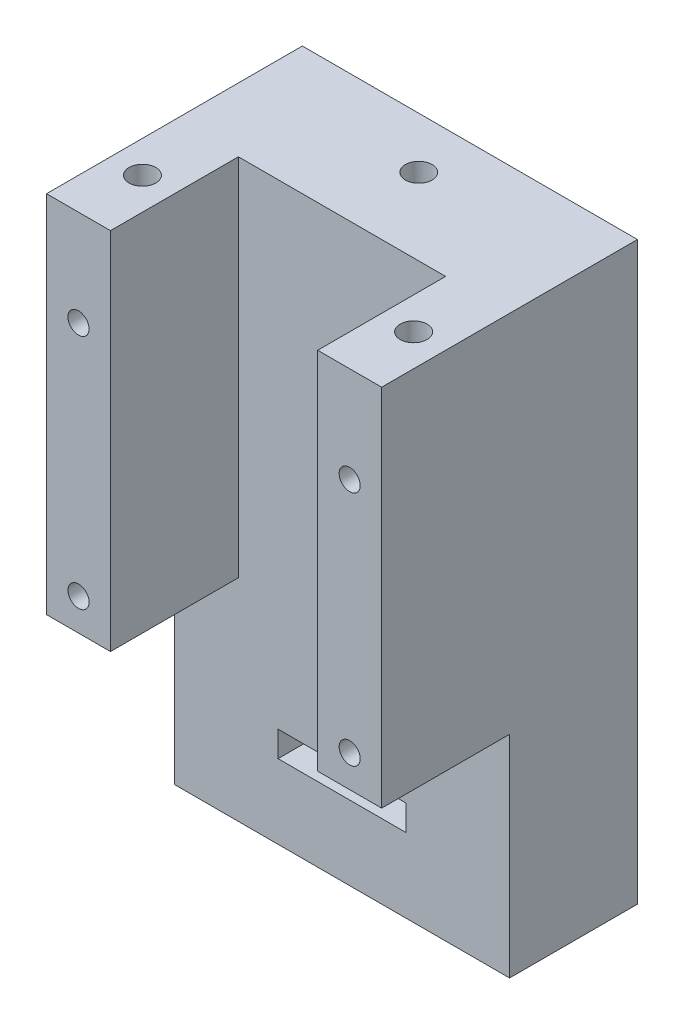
ISO-10303-21;
HEADER;
FILE_DESCRIPTION(('STEP AP214'),'2;1');
FILE_NAME('part.step','',(''),(''),'','','');
FILE_SCHEMA(('AUTOMOTIVE_DESIGN { 1 0 10303 214 1 1 1 1 }'));
ENDSEC;
DATA;
#1=APPLICATION_CONTEXT('core data for automotive mechanical design processes');
#2=APPLICATION_PROTOCOL_DEFINITION('international standard','automotive_design',2000,#1);
#3=PRODUCT_CONTEXT('',#1,'mechanical');
#4=PRODUCT('Part','Part','',(#3));
#5=PRODUCT_RELATED_PRODUCT_CATEGORY('part','',(#4));
#6=PRODUCT_DEFINITION_FORMATION('','',#4);
#7=PRODUCT_DEFINITION_CONTEXT('part definition',#1,'design');
#8=PRODUCT_DEFINITION('design','',#6,#7);
#9=PRODUCT_DEFINITION_SHAPE('','',#8);
#10=(LENGTH_UNIT() NAMED_UNIT(*) SI_UNIT(.MILLI.,.METRE.));
#11=(NAMED_UNIT(*) PLANE_ANGLE_UNIT() SI_UNIT($,.RADIAN.));
#12=(NAMED_UNIT(*) SI_UNIT($,.STERADIAN.) SOLID_ANGLE_UNIT());
#13=UNCERTAINTY_MEASURE_WITH_UNIT(LENGTH_MEASURE(1.E-05),#10,'distance_accuracy_value','');
#14=(GEOMETRIC_REPRESENTATION_CONTEXT(3) GLOBAL_UNCERTAINTY_ASSIGNED_CONTEXT((#13)) GLOBAL_UNIT_ASSIGNED_CONTEXT((#10,
#11,#12)) REPRESENTATION_CONTEXT('',''));
#15=CARTESIAN_POINT('',(0.,0.,0.));
#16=DIRECTION('',(0.,0.,1.));
#17=DIRECTION('',(1.,0.,0.));
#18=AXIS2_PLACEMENT_3D('',#15,#16,#17);
#19=CARTESIAN_POINT('',(47.4000000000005,75.0000000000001,25.));
#20=DIRECTION('',(0.,0.,1.));
#21=DIRECTION('',(1.,0.,0.));
#22=AXIS2_PLACEMENT_3D('',#19,#20,#21);
#23=CYLINDRICAL_SURFACE('',#22,1.65);
#24=CARTESIAN_POINT('',(47.4000000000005,75.0000000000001,40.));
#25=DIRECTION('',(0.,0.,1.));
#26=DIRECTION('',(1.,0.,0.));
#27=AXIS2_PLACEMENT_3D('',#24,#25,#26);
#28=CIRCLE('',#27,1.65);
#29=CARTESIAN_POINT('',(49.0500000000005,75.0000000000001,40.));
#30=VERTEX_POINT('',#29);
#31=EDGE_CURVE('E282',#30,#30,#28,.T.);
#32=ORIENTED_EDGE('',*,*,#31,.T.);
#33=EDGE_LOOP('',(#32));
#34=FACE_BOUND('',#33,.T.);
#35=CARTESIAN_POINT('',(47.4000000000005,75.0000000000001,25.));
#36=DIRECTION('',(0.,0.,1.));
#37=DIRECTION('',(1.,0.,0.));
#38=AXIS2_PLACEMENT_3D('',#35,#36,#37);
#39=CIRCLE('',#38,1.65);
#40=CARTESIAN_POINT('',(49.0500000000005,75.0000000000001,25.));
#41=VERTEX_POINT('',#40);
#42=EDGE_CURVE('E285',#41,#41,#39,.T.);
#43=ORIENTED_EDGE('',*,*,#42,.F.);
#44=EDGE_LOOP('',(#43));
#45=FACE_BOUND('',#44,.T.);
#46=DIRECTION('',(0.,0.,1.));
#47=VECTOR('',#46,1.);
#48=CARTESIAN_POINT('',(45.7500000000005,75.0000000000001,25.));
#49=LINE('',#48,#47);
#50=CARTESIAN_POINT('',(45.7500000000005,75.0000000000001,31.2990381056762));
#51=VERTEX_POINT('',#50);
#52=CARTESIAN_POINT('',(45.7500000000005,75.0000000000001,28.7009618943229));
#53=VERTEX_POINT('',#52);
#54=EDGE_CURVE('E12',#51,#53,#49,.F.);
#55=ORIENTED_EDGE('',*,*,#54,.F.);
#56=CARTESIAN_POINT('',(45.7500000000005,75.0000000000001,31.2990381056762));
#57=CARTESIAN_POINT('',(45.7499947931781,75.0320263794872,31.2990226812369));
#58=CARTESIAN_POINT('',(45.7509328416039,75.0640329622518,31.3002235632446));
#59=CARTESIAN_POINT('',(45.7546429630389,75.1277200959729,31.3049192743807));
#60=CARTESIAN_POINT('',(45.7574120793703,75.1594010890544,31.3084104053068));
#61=CARTESIAN_POINT('',(45.7682944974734,75.2528435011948,31.3219959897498));
#62=CARTESIAN_POINT('',(45.7789860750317,75.3138701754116,31.3352102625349));
#63=CARTESIAN_POINT('',(45.8112612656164,75.4528965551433,31.3735776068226));
#64=CARTESIAN_POINT('',(45.8353158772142,75.52958753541,31.4012652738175));
#65=CARTESIAN_POINT('',(45.8931151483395,75.6768388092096,31.4632528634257));
#66=CARTESIAN_POINT('',(45.9269272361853,75.7473518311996,31.4975982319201));
#67=CARTESIAN_POINT('',(46.0159069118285,75.9040895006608,31.5808584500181));
#68=CARTESIAN_POINT('',(46.0744401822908,75.9878365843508,31.6308453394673));
#69=CARTESIAN_POINT('',(46.2061324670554,76.143474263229,31.7295840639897));
#70=CARTESIAN_POINT('',(46.2792651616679,76.2153857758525,31.778337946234));
#71=CARTESIAN_POINT('',(46.4244994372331,76.3333768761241,31.8611819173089));
#72=CARTESIAN_POINT('',(46.4941333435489,76.3817671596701,31.8962946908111));
#73=CARTESIAN_POINT('',(46.6422022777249,76.4681838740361,31.9601571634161));
#74=CARTESIAN_POINT('',(46.7206251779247,76.5062243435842,31.9889154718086));
#75=CARTESIAN_POINT('',(46.8719834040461,76.5649964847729,32.033818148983));
#76=CARTESIAN_POINT('',(46.9438458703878,76.5875083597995,32.0512342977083));
#77=CARTESIAN_POINT('',(47.0913381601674,76.6226406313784,32.0785425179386));
#78=CARTESIAN_POINT('',(47.1669658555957,76.63526654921,32.0884387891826));
#79=CARTESIAN_POINT('',(47.3201301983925,76.6498652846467,32.0998891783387));
#80=CARTESIAN_POINT('',(47.3976721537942,76.651804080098,32.1014166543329));
#81=CARTESIAN_POINT('',(47.5519543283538,76.6448020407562,32.0959172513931));
#82=CARTESIAN_POINT('',(47.6286944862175,76.6358603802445,32.0888897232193));
#83=CARTESIAN_POINT('',(47.7753115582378,76.6083945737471,32.0674536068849));
#84=CARTESIAN_POINT('',(47.8453401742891,76.590366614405,32.0534275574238));
#85=CARTESIAN_POINT('',(47.9810803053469,76.5459466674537,32.0192203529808));
#86=CARTESIAN_POINT('',(48.0467906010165,76.5195523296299,31.9990374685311));
#87=CARTESIAN_POINT('',(48.1792296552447,76.4564375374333,31.9514702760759));
#88=CARTESIAN_POINT('',(48.2454020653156,76.4189479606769,31.923567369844));
#89=CARTESIAN_POINT('',(48.3706678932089,76.3363904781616,31.8635014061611));
#90=CARTESIAN_POINT('',(48.429758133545,76.291319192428,31.8313364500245));
#91=CARTESIAN_POINT('',(48.5518887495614,76.1846944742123,31.7576172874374));
#92=CARTESIAN_POINT('',(48.6132805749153,76.1216539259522,31.7154853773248));
#93=CARTESIAN_POINT('',(48.7252905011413,75.9868187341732,31.6305057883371));
#94=CARTESIAN_POINT('',(48.7758869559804,75.9150069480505,31.5876568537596));
#95=CARTESIAN_POINT('',(48.8598388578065,75.7728297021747,31.5105236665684));
#96=CARTESIAN_POINT('',(48.8945825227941,75.7034981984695,31.4758514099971));
#97=CARTESIAN_POINT('',(48.9545130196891,75.5586494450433,31.4125766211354));
#98=CARTESIAN_POINT('',(48.9797574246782,75.4831729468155,31.3839380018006));
#99=CARTESIAN_POINT('',(49.0157806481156,75.3407041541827,31.3416006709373));
#100=CARTESIAN_POINT('',(49.0283748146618,75.2747376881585,31.3261155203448));
#101=CARTESIAN_POINT('',(49.0412227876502,75.1734141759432,31.3101276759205));
#102=CARTESIAN_POINT('',(49.0444994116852,75.1389906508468,31.3060022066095));
#103=CARTESIAN_POINT('',(49.0488938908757,75.0697210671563,31.3004437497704));
#104=CARTESIAN_POINT('',(49.0500072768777,75.0348742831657,31.2990163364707));
#105=CARTESIAN_POINT('',(49.0500000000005,75.0000000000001,31.2990381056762));
#106=B_SPLINE_CURVE_WITH_KNOTS('',3,(#56,#57,#58,#59,#60,#61,#62,#63,#64,#65,#66,#67,#68,#69,
#70,#71,#72,#73,#74,#75,#76,#77,#78,#79,#80,#81,#82,#83,#84,#85,#86,#87,#88,#89,#90,#91,#92,#93,
#94,#95,#96,#97,#98,#99,#100,#101,#102,#103,#104,#105),.UNSPECIFIED.,.F.,.F.,(4,2,2,2,2,2,2,2,2,
2,2,2,2,2,2,2,2,2,2,2,2,2,2,2,4),(0.,0.0960078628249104,0.191861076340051,0.38100886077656,
0.634658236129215,0.890104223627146,1.22971075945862,1.56871049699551,1.84300333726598,
2.11692224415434,2.3478163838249,2.57858147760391,2.81008078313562,3.04159765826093,
3.26165567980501,3.4817755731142,3.72392726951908,3.96618720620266,4.25781138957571,
4.55001493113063,4.80409048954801,5.05660034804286,5.2622375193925,5.36655004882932,
5.4710778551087),.UNSPECIFIED.);
#107=CARTESIAN_POINT('',(49.0500000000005,75.0000000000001,31.2990381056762));
#108=VERTEX_POINT('',#107);
#109=EDGE_CURVE('E42',#51,#108,#106,.T.);
#110=ORIENTED_EDGE('',*,*,#109,.T.);
#111=DIRECTION('',(0.,0.,1.));
#112=VECTOR('',#111,1.);
#113=CARTESIAN_POINT('',(49.0500000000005,75.0000000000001,25.));
#114=LINE('',#113,#112);
#115=CARTESIAN_POINT('',(49.0500000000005,75.0000000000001,28.7009618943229));
#116=VERTEX_POINT('',#115);
#117=EDGE_CURVE('E156',#116,#108,#114,.T.);
#118=ORIENTED_EDGE('',*,*,#117,.F.);
#119=CARTESIAN_POINT('',(49.0500000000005,75.0000000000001,28.7009618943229));
#120=CARTESIAN_POINT('',(49.050005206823,75.0320263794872,28.7009773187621));
#121=CARTESIAN_POINT('',(49.0490671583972,75.0640329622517,28.6997764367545));
#122=CARTESIAN_POINT('',(49.0453570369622,75.1277200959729,28.6950807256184));
#123=CARTESIAN_POINT('',(49.0425879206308,75.1594010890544,28.6915895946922));
#124=CARTESIAN_POINT('',(49.0317055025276,75.2528435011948,28.6780040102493));
#125=CARTESIAN_POINT('',(49.0210139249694,75.3138701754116,28.6647897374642));
#126=CARTESIAN_POINT('',(48.9887387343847,75.4528965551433,28.6264223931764));
#127=CARTESIAN_POINT('',(48.9646841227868,75.52958753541,28.5987347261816));
#128=CARTESIAN_POINT('',(48.9068848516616,75.6768388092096,28.5367471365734));
#129=CARTESIAN_POINT('',(48.8730727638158,75.7473518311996,28.502401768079));
#130=CARTESIAN_POINT('',(48.7840930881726,75.9040895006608,28.4191415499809));
#131=CARTESIAN_POINT('',(48.7255598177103,75.9878365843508,28.3691546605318));
#132=CARTESIAN_POINT('',(48.5938675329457,76.143474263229,28.2704159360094));
#133=CARTESIAN_POINT('',(48.5207348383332,76.2153857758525,28.2216620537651));
#134=CARTESIAN_POINT('',(48.375500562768,76.3333768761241,28.1388180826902));
#135=CARTESIAN_POINT('',(48.3058666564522,76.3817671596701,28.103705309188));
#136=CARTESIAN_POINT('',(48.1577977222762,76.4681838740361,28.039842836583));
#137=CARTESIAN_POINT('',(48.0793748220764,76.5062243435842,28.0110845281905));
#138=CARTESIAN_POINT('',(47.9280165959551,76.5649964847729,27.9661818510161));
#139=CARTESIAN_POINT('',(47.8561541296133,76.5875083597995,27.9487657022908));
#140=CARTESIAN_POINT('',(47.7086618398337,76.6226406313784,27.9214574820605));
#141=CARTESIAN_POINT('',(47.6330341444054,76.63526654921,27.9115612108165));
#142=CARTESIAN_POINT('',(47.4798698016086,76.6498652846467,27.9001108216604));
#143=CARTESIAN_POINT('',(47.4023278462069,76.651804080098,27.8985833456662));
#144=CARTESIAN_POINT('',(47.2480456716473,76.6448020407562,27.904082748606));
#145=CARTESIAN_POINT('',(47.1713055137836,76.6358603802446,27.9111102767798));
#146=CARTESIAN_POINT('',(47.0246884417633,76.6083945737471,27.9325463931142));
#147=CARTESIAN_POINT('',(46.954659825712,76.590366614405,27.9465724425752));
#148=CARTESIAN_POINT('',(46.8189196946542,76.5459466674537,27.9807796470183));
#149=CARTESIAN_POINT('',(46.7532093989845,76.5195523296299,28.000962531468));
#150=CARTESIAN_POINT('',(46.6207703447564,76.4564375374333,28.0485297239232));
#151=CARTESIAN_POINT('',(46.5545979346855,76.4189479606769,28.0764326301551));
#152=CARTESIAN_POINT('',(46.4293321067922,76.3363904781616,28.136498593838));
#153=CARTESIAN_POINT('',(46.3702418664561,76.291319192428,28.1686635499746));
#154=CARTESIAN_POINT('',(46.2481112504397,76.1846944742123,28.2423827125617));
#155=CARTESIAN_POINT('',(46.1867194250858,76.1216539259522,28.2845146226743));
#156=CARTESIAN_POINT('',(46.0747094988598,75.9868187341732,28.369494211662));
#157=CARTESIAN_POINT('',(46.0241130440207,75.9150069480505,28.4123431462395));
#158=CARTESIAN_POINT('',(45.9401611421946,75.7728297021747,28.4894763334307));
#159=CARTESIAN_POINT('',(45.905417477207,75.7034981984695,28.524148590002));
#160=CARTESIAN_POINT('',(45.845486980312,75.5586494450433,28.5874233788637));
#161=CARTESIAN_POINT('',(45.8202425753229,75.4831729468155,28.6160619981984));
#162=CARTESIAN_POINT('',(45.7842193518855,75.3407041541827,28.6583993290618));
#163=CARTESIAN_POINT('',(45.7716251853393,75.2747376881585,28.6738844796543));
#164=CARTESIAN_POINT('',(45.7587772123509,75.1734141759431,28.6898723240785));
#165=CARTESIAN_POINT('',(45.7555005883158,75.1389906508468,28.6939977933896));
#166=CARTESIAN_POINT('',(45.7511061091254,75.0697210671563,28.6995562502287));
#167=CARTESIAN_POINT('',(45.7499927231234,75.0348742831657,28.7009836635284));
#168=CARTESIAN_POINT('',(45.7500000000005,75.0000000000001,28.7009618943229));
#169=B_SPLINE_CURVE_WITH_KNOTS('',3,(#119,#120,#121,#122,#123,#124,#125,#126,#127,#128,#129,
#130,#131,#132,#133,#134,#135,#136,#137,#138,#139,#140,#141,#142,#143,#144,#145,#146,#147,#148,
#149,#150,#151,#152,#153,#154,#155,#156,#157,#158,#159,#160,#161,#162,#163,#164,#165,#166,#167,
#168),.UNSPECIFIED.,.F.,.F.,(4,2,2,2,2,2,2,2,2,2,2,2,2,2,2,2,2,2,2,2,2,2,2,2,4),(0.,
0.0960078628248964,0.191861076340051,0.381008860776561,0.634658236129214,0.890104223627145,
1.22971075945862,1.5687104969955,1.84300333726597,2.11692224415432,2.34781638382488,
2.57858147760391,2.81008078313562,3.04159765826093,3.26165567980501,3.4817755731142,
3.72392726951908,3.96618720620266,4.25781138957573,4.55001493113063,4.80409048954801,
5.05660034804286,5.26223751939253,5.36655004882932,5.4710778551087),.UNSPECIFIED.);
#170=EDGE_CURVE('E161',#116,#53,#169,.T.);
#171=ORIENTED_EDGE('',*,*,#170,.T.);
#172=EDGE_LOOP('',(#55,#110,#118,#171));
#173=FACE_BOUND('',#172,.T.);
#174=ADVANCED_FACE('F34',(#34,#45,#173),#23,.F.);
#175=CARTESIAN_POINT('',(5.,74.9999999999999,25.));
#176=DIRECTION('',(0.,0.,1.));
#177=DIRECTION('',(1.,0.,0.));
#178=AXIS2_PLACEMENT_3D('',#175,#176,#177);
#179=CYLINDRICAL_SURFACE('',#178,1.65);
#180=CARTESIAN_POINT('',(5.,74.9999999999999,40.));
#181=DIRECTION('',(0.,0.,1.));
#182=DIRECTION('',(1.,0.,0.));
#183=AXIS2_PLACEMENT_3D('',#180,#181,#182);
#184=CIRCLE('',#183,1.65);
#185=CARTESIAN_POINT('',(6.65,74.9999999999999,40.));
#186=VERTEX_POINT('',#185);
#187=EDGE_CURVE('E287',#186,#186,#184,.T.);
#188=ORIENTED_EDGE('',*,*,#187,.T.);
#189=EDGE_LOOP('',(#188));
#190=FACE_BOUND('',#189,.T.);
#191=CARTESIAN_POINT('',(5.,74.9999999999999,25.));
#192=DIRECTION('',(0.,0.,1.));
#193=DIRECTION('',(1.,0.,0.));
#194=AXIS2_PLACEMENT_3D('',#191,#192,#193);
#195=CIRCLE('',#194,1.65);
#196=CARTESIAN_POINT('',(6.65,74.9999999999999,25.));
#197=VERTEX_POINT('',#196);
#198=EDGE_CURVE('E290',#197,#197,#195,.T.);
#199=ORIENTED_EDGE('',*,*,#198,.F.);
#200=EDGE_LOOP('',(#199));
#201=FACE_BOUND('',#200,.T.);
#202=DIRECTION('',(0.,0.,1.));
#203=VECTOR('',#202,1.);
#204=CARTESIAN_POINT('',(3.35,75.0000000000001,25.));
#205=LINE('',#204,#203);
#206=CARTESIAN_POINT('',(3.35,75.0000000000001,31.2990381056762));
#207=VERTEX_POINT('',#206);
#208=CARTESIAN_POINT('',(3.35,75.0000000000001,28.7009618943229));
#209=VERTEX_POINT('',#208);
#210=EDGE_CURVE('E162',#207,#209,#205,.F.);
#211=ORIENTED_EDGE('',*,*,#210,.F.);
#212=CARTESIAN_POINT('',(3.35,75.0000000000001,31.2990381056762));
#213=CARTESIAN_POINT('',(3.34999479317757,75.0320263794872,31.2990226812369));
#214=CARTESIAN_POINT('',(3.35093284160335,75.0640329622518,31.3002235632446));
#215=CARTESIAN_POINT('',(3.35464296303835,75.1277200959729,31.3049192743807));
#216=CARTESIAN_POINT('',(3.35741207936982,75.1594010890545,31.3084104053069));
#217=CARTESIAN_POINT('',(3.36829449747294,75.2528435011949,31.3219959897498));
#218=CARTESIAN_POINT('',(3.37898607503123,75.3138701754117,31.335210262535));
#219=CARTESIAN_POINT('',(3.41126126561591,75.4528965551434,31.3735776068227));
#220=CARTESIAN_POINT('',(3.4353158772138,75.5295875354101,31.4012652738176));
#221=CARTESIAN_POINT('',(3.49311514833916,75.6768388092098,31.4632528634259));
#222=CARTESIAN_POINT('',(3.52692723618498,75.7473518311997,31.4975982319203));
#223=CARTESIAN_POINT('',(3.61590691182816,75.904089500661,31.5808584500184));
#224=CARTESIAN_POINT('',(3.67444018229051,75.9878365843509,31.6308453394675));
#225=CARTESIAN_POINT('',(3.80613246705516,76.1434742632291,31.7295840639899));
#226=CARTESIAN_POINT('',(3.87926516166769,76.2153857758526,31.7783379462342));
#227=CARTESIAN_POINT('',(4.02449943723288,76.3333768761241,31.8611819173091));
#228=CARTESIAN_POINT('',(4.09413334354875,76.3817671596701,31.8962946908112));
#229=CARTESIAN_POINT('',(4.24220227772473,76.468183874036,31.9601571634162));
#230=CARTESIAN_POINT('',(4.3206251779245,76.5062243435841,31.9889154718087));
#231=CARTESIAN_POINT('',(4.47198340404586,76.5649964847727,32.033818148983));
#232=CARTESIAN_POINT('',(4.54384587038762,76.5875083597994,32.0512342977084));
#233=CARTESIAN_POINT('',(4.69133816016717,76.6226406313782,32.0785425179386));
#234=CARTESIAN_POINT('',(4.7669658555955,76.6352665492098,32.0884387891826));
#235=CARTESIAN_POINT('',(4.92013019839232,76.6498652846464,32.0998891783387));
#236=CARTESIAN_POINT('',(4.99767215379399,76.6518040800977,32.1014166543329));
#237=CARTESIAN_POINT('',(5.1519543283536,76.6448020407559,32.0959172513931));
#238=CARTESIAN_POINT('',(5.22869448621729,76.6358603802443,32.0888897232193));
#239=CARTESIAN_POINT('',(5.3753115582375,76.6083945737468,32.0674536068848));
#240=CARTESIAN_POINT('',(5.44534017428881,76.5903666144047,32.0534275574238));
#241=CARTESIAN_POINT('',(5.58108030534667,76.5459466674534,32.0192203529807));
#242=CARTESIAN_POINT('',(5.64679060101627,76.5195523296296,31.999037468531));
#243=CARTESIAN_POINT('',(5.77922965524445,76.4564375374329,31.9514702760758));
#244=CARTESIAN_POINT('',(5.84540206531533,76.4189479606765,31.9235673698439));
#245=CARTESIAN_POINT('',(5.97066789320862,76.3363904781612,31.863501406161));
#246=CARTESIAN_POINT('',(6.02975813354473,76.2913191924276,31.8313364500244));
#247=CARTESIAN_POINT('',(6.1518887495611,76.1846944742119,31.7576172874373));
#248=CARTESIAN_POINT('',(6.21328057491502,76.1216539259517,31.7154853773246));
#249=CARTESIAN_POINT('',(6.32529050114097,75.9868187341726,31.6305057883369));
#250=CARTESIAN_POINT('',(6.37588695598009,75.9150069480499,31.5876568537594));
#251=CARTESIAN_POINT('',(6.4598388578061,75.7728297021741,31.5105236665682));
#252=CARTESIAN_POINT('',(6.49458252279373,75.7034981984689,31.475851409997));
#253=CARTESIAN_POINT('',(6.55451301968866,75.5586494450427,31.4125766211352));
#254=CARTESIAN_POINT('',(6.57975742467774,75.483172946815,31.3839380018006));
#255=CARTESIAN_POINT('',(6.61578064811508,75.3407041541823,31.3416006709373));
#256=CARTESIAN_POINT('',(6.62837481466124,75.2747376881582,31.3261155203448));
#257=CARTESIAN_POINT('',(6.64122278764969,75.1734141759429,31.3101276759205));
#258=CARTESIAN_POINT('',(6.64449941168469,75.1389906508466,31.3060022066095));
#259=CARTESIAN_POINT('',(6.64889389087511,75.0697210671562,31.3004437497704));
#260=CARTESIAN_POINT('',(6.65000727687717,75.0348742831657,31.2990163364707));
#261=CARTESIAN_POINT('',(6.65,75.0000000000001,31.2990381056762));
#262=B_SPLINE_CURVE_WITH_KNOTS('',3,(#212,#213,#214,#215,#216,#217,#218,#219,#220,#221,#222,
#223,#224,#225,#226,#227,#228,#229,#230,#231,#232,#233,#234,#235,#236,#237,#238,#239,#240,#241,
#242,#243,#244,#245,#246,#247,#248,#249,#250,#251,#252,#253,#254,#255,#256,#257,#258,#259,#260,
#261),.UNSPECIFIED.,.F.,.F.,(4,2,2,2,2,2,2,2,2,2,2,2,2,2,2,2,2,2,2,2,2,2,2,2,4),(0.,
0.0960078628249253,0.191861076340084,0.381008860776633,0.634658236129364,0.890104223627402,
1.22971075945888,1.56871049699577,1.84300333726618,2.11692224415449,2.34781638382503,
2.57858147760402,2.81008078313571,3.041597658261,3.26165567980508,3.48177557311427,
3.72392726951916,3.96618720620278,4.25781138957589,4.55001493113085,4.80409048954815,
5.05660034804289,5.26223751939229,5.36655004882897,5.47107785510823),.UNSPECIFIED.);
#263=CARTESIAN_POINT('',(6.65,75.0000000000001,31.2990381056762));
#264=VERTEX_POINT('',#263);
#265=EDGE_CURVE('E213',#207,#264,#262,.T.);
#266=ORIENTED_EDGE('',*,*,#265,.T.);
#267=DIRECTION('',(0.,0.,1.));
#268=VECTOR('',#267,1.);
#269=CARTESIAN_POINT('',(6.65,75.0000000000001,25.));
#270=LINE('',#269,#268);
#271=CARTESIAN_POINT('',(6.65,75.0000000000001,28.7009618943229));
#272=VERTEX_POINT('',#271);
#273=EDGE_CURVE('E386',#272,#264,#270,.T.);
#274=ORIENTED_EDGE('',*,*,#273,.F.);
#275=CARTESIAN_POINT('',(6.65,75.0000000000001,28.7009618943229));
#276=CARTESIAN_POINT('',(6.65000520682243,75.0320263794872,28.7009773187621));
#277=CARTESIAN_POINT('',(6.64906715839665,75.0640329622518,28.6997764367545));
#278=CARTESIAN_POINT('',(6.64535703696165,75.1277200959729,28.6950807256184));
#279=CARTESIAN_POINT('',(6.64258792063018,75.1594010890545,28.6915895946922));
#280=CARTESIAN_POINT('',(6.63170550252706,75.2528435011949,28.6780040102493));
#281=CARTESIAN_POINT('',(6.62101392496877,75.3138701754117,28.6647897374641));
#282=CARTESIAN_POINT('',(6.58873873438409,75.4528965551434,28.6264223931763));
#283=CARTESIAN_POINT('',(6.5646841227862,75.5295875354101,28.5987347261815));
#284=CARTESIAN_POINT('',(6.50688485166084,75.6768388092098,28.5367471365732));
#285=CARTESIAN_POINT('',(6.47307276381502,75.7473518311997,28.5024017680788));
#286=CARTESIAN_POINT('',(6.38409308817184,75.904089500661,28.4191415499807));
#287=CARTESIAN_POINT('',(6.32555981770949,75.9878365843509,28.3691546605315));
#288=CARTESIAN_POINT('',(6.19386753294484,76.1434742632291,28.2704159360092));
#289=CARTESIAN_POINT('',(6.12073483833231,76.2153857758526,28.2216620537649));
#290=CARTESIAN_POINT('',(5.97550056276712,76.3333768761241,28.13881808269));
#291=CARTESIAN_POINT('',(5.90586665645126,76.3817671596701,28.1037053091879));
#292=CARTESIAN_POINT('',(5.75779772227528,76.468183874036,28.0398428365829));
#293=CARTESIAN_POINT('',(5.6793748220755,76.5062243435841,28.0110845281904));
#294=CARTESIAN_POINT('',(5.52801659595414,76.5649964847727,27.966181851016));
#295=CARTESIAN_POINT('',(5.45615412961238,76.5875083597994,27.9487657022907));
#296=CARTESIAN_POINT('',(5.30866183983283,76.6226406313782,27.9214574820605));
#297=CARTESIAN_POINT('',(5.23303414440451,76.6352665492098,27.9115612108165));
#298=CARTESIAN_POINT('',(5.07986980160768,76.6498652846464,27.9001108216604));
#299=CARTESIAN_POINT('',(5.00232784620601,76.6518040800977,27.8985833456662));
#300=CARTESIAN_POINT('',(4.8480456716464,76.6448020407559,27.904082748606));
#301=CARTESIAN_POINT('',(4.77130551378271,76.6358603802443,27.9111102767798));
#302=CARTESIAN_POINT('',(4.6246884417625,76.6083945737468,27.9325463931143));
#303=CARTESIAN_POINT('',(4.55465982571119,76.5903666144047,27.9465724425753));
#304=CARTESIAN_POINT('',(4.41891969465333,76.5459466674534,27.9807796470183));
#305=CARTESIAN_POINT('',(4.35320939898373,76.5195523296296,28.0009625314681));
#306=CARTESIAN_POINT('',(4.22077034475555,76.4564375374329,28.0485297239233));
#307=CARTESIAN_POINT('',(4.15459793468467,76.4189479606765,28.0764326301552));
#308=CARTESIAN_POINT('',(4.02933210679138,76.3363904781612,28.1364985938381));
#309=CARTESIAN_POINT('',(3.97024186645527,76.2913191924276,28.1686635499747));
#310=CARTESIAN_POINT('',(3.8481112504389,76.1846944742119,28.2423827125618));
#311=CARTESIAN_POINT('',(3.78671942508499,76.1216539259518,28.2845146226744));
#312=CARTESIAN_POINT('',(3.67470949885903,75.9868187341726,28.3694942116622));
#313=CARTESIAN_POINT('',(3.62411304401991,75.9150069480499,28.4123431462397));
#314=CARTESIAN_POINT('',(3.5401611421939,75.7728297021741,28.4894763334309));
#315=CARTESIAN_POINT('',(3.50541747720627,75.7034981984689,28.5241485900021));
#316=CARTESIAN_POINT('',(3.44548698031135,75.5586494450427,28.5874233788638));
#317=CARTESIAN_POINT('',(3.42024257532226,75.483172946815,28.6160619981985));
#318=CARTESIAN_POINT('',(3.38421935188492,75.3407041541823,28.6583993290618));
#319=CARTESIAN_POINT('',(3.37162518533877,75.2747376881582,28.6738844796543));
#320=CARTESIAN_POINT('',(3.35877721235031,75.1734141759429,28.6898723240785));
#321=CARTESIAN_POINT('',(3.35550058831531,75.1389906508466,28.6939977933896));
#322=CARTESIAN_POINT('',(3.35110610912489,75.0697210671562,28.6995562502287));
#323=CARTESIAN_POINT('',(3.34999272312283,75.0348742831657,28.7009836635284));
#324=CARTESIAN_POINT('',(3.35,75.0000000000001,28.7009618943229));
#325=B_SPLINE_CURVE_WITH_KNOTS('',3,(#275,#276,#277,#278,#279,#280,#281,#282,#283,#284,#285,
#286,#287,#288,#289,#290,#291,#292,#293,#294,#295,#296,#297,#298,#299,#300,#301,#302,#303,#304,
#305,#306,#307,#308,#309,#310,#311,#312,#313,#314,#315,#316,#317,#318,#319,#320,#321,#322,#323,
#324),.UNSPECIFIED.,.F.,.F.,(4,2,2,2,2,2,2,2,2,2,2,2,2,2,2,2,2,2,2,2,2,2,2,2,4),(0.,
0.0960078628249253,0.191861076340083,0.381008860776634,0.634658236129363,0.890104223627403,
1.22971075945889,1.56871049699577,1.84300333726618,2.11692224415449,2.34781638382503,
2.57858147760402,2.81008078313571,3.041597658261,3.26165567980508,3.48177557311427,
3.72392726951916,3.96618720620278,4.25781138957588,4.55001493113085,4.80409048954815,
5.05660034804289,5.26223751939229,5.36655004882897,5.47107785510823),.UNSPECIFIED.);
#326=EDGE_CURVE('E206',#272,#209,#325,.T.);
#327=ORIENTED_EDGE('',*,*,#326,.T.);
#328=EDGE_LOOP('',(#211,#266,#274,#327));
#329=FACE_BOUND('',#328,.T.);
#330=ADVANCED_FACE('F219',(#190,#201,#329),#179,.F.);
#331=CARTESIAN_POINT('',(52.4000000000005,1.13686837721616E-13,40.));
#332=DIRECTION('',(0.,0.,1.));
#333=DIRECTION('',(1.,0.,0.));
#334=AXIS2_PLACEMENT_3D('',#331,#332,#333);
#335=PLANE('',#334);
#336=ORIENTED_EDGE('',*,*,#31,.F.);
#337=EDGE_LOOP('',(#336));
#338=FACE_BOUND('',#337,.T.);
#339=CARTESIAN_POINT('',(47.4000000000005,37.9999999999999,40.));
#340=DIRECTION('',(0.,0.,1.));
#341=DIRECTION('',(1.,0.,0.));
#342=AXIS2_PLACEMENT_3D('',#339,#340,#341);
#343=CIRCLE('',#342,1.65);
#344=CARTESIAN_POINT('',(49.0500000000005,37.9999999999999,40.));
#345=VERTEX_POINT('',#344);
#346=EDGE_CURVE('E295',#345,#345,#343,.T.);
#347=ORIENTED_EDGE('',*,*,#346,.F.);
#348=EDGE_LOOP('',(#347));
#349=FACE_BOUND('',#348,.T.);
#350=DIRECTION('',(-1.,0.,0.));
#351=VECTOR('',#350,1.);
#352=CARTESIAN_POINT('',(0.,90.0000000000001,40.));
#353=LINE('',#352,#351);
#354=CARTESIAN_POINT('',(52.4000000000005,90.0000000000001,40.));
#355=VERTEX_POINT('',#354);
#356=CARTESIAN_POINT('',(42.4000000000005,90.0000000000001,40.));
#357=VERTEX_POINT('',#356);
#358=EDGE_CURVE('E354',#355,#357,#353,.T.);
#359=ORIENTED_EDGE('',*,*,#358,.T.);
#360=DIRECTION('',(0.,1.,0.));
#361=VECTOR('',#360,1.);
#362=CARTESIAN_POINT('',(42.4000000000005,0.,40.));
#363=LINE('',#362,#361);
#364=CARTESIAN_POINT('',(42.4000000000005,33.,40.));
#365=VERTEX_POINT('',#364);
#366=EDGE_CURVE('E417',#365,#357,#363,.T.);
#367=ORIENTED_EDGE('',*,*,#366,.F.);
#368=DIRECTION('',(1.,0.,0.));
#369=VECTOR('',#368,1.);
#370=CARTESIAN_POINT('',(0.,33.,40.));
#371=LINE('',#370,#369);
#372=CARTESIAN_POINT('',(52.4000000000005,33.,40.));
#373=VERTEX_POINT('',#372);
#374=EDGE_CURVE('E307',#365,#373,#371,.T.);
#375=ORIENTED_EDGE('',*,*,#374,.T.);
#376=DIRECTION('',(0.,1.,0.));
#377=VECTOR('',#376,1.);
#378=CARTESIAN_POINT('',(52.4000000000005,1.13686837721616E-13,40.));
#379=LINE('',#378,#377);
#380=EDGE_CURVE('E350',#373,#355,#379,.T.);
#381=ORIENTED_EDGE('',*,*,#380,.T.);
#382=EDGE_LOOP('',(#359,#367,#375,#381));
#383=FACE_BOUND('',#382,.T.);
#384=ADVANCED_FACE('F223',(#338,#349,#383),#335,.T.);
#385=ORIENTED_EDGE('',*,*,#187,.F.);
#386=EDGE_LOOP('',(#385));
#387=FACE_BOUND('',#386,.T.);
#388=CARTESIAN_POINT('',(5.,37.9999999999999,40.));
#389=DIRECTION('',(0.,0.,1.));
#390=DIRECTION('',(1.,0.,0.));
#391=AXIS2_PLACEMENT_3D('',#388,#389,#390);
#392=CIRCLE('',#391,1.65);
#393=CARTESIAN_POINT('',(6.65,37.9999999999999,40.));
#394=VERTEX_POINT('',#393);
#395=EDGE_CURVE('E419',#394,#394,#392,.T.);
#396=ORIENTED_EDGE('',*,*,#395,.F.);
#397=EDGE_LOOP('',(#396));
#398=FACE_BOUND('',#397,.T.);
#399=CARTESIAN_POINT('',(0.,33.,40.));
#400=VERTEX_POINT('',#399);
#401=CARTESIAN_POINT('',(10.,33.,40.));
#402=VERTEX_POINT('',#401);
#403=EDGE_CURVE('E318',#400,#402,#371,.T.);
#404=ORIENTED_EDGE('',*,*,#403,.T.);
#405=DIRECTION('',(0.,1.,0.));
#406=VECTOR('',#405,1.);
#407=CARTESIAN_POINT('',(10.,0.,40.));
#408=LINE('',#407,#406);
#409=CARTESIAN_POINT('',(10.,90.0000000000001,40.));
#410=VERTEX_POINT('',#409);
#411=EDGE_CURVE('E416',#402,#410,#408,.T.);
#412=ORIENTED_EDGE('',*,*,#411,.T.);
#413=CARTESIAN_POINT('',(0.,90.0000000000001,40.));
#414=VERTEX_POINT('',#413);
#415=EDGE_CURVE('E352',#410,#414,#353,.T.);
#416=ORIENTED_EDGE('',*,*,#415,.T.);
#417=DIRECTION('',(0.,-1.,0.));
#418=VECTOR('',#417,1.);
#419=CARTESIAN_POINT('',(0.,1.13686837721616E-13,40.));
#420=LINE('',#419,#418);
#421=EDGE_CURVE('E357',#414,#400,#420,.T.);
#422=ORIENTED_EDGE('',*,*,#421,.T.);
#423=EDGE_LOOP('',(#404,#412,#416,#422));
#424=FACE_BOUND('',#423,.T.);
#425=ADVANCED_FACE('F257',(#387,#398,#424),#335,.T.);
#426=CARTESIAN_POINT('',(0.,90.0000000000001,40.));
#427=DIRECTION('',(0.,-1.,0.));
#428=DIRECTION('',(0.,0.,-1.));
#429=AXIS2_PLACEMENT_3D('',#426,#427,#428);
#430=PLANE('',#429);
#431=CARTESIAN_POINT('',(47.4000000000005,90.0000000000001,29.9999999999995));
#432=DIRECTION('',(0.,1.,0.));
#433=DIRECTION('',(0.,0.,1.));
#434=AXIS2_PLACEMENT_3D('',#431,#432,#433);
#435=CIRCLE('',#434,2.1);
#436=CARTESIAN_POINT('',(47.4000000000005,90.0000000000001,32.0999999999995));
#437=VERTEX_POINT('',#436);
#438=EDGE_CURVE('E400',#437,#437,#435,.T.);
#439=ORIENTED_EDGE('',*,*,#438,.F.);
#440=EDGE_LOOP('',(#439));
#441=FACE_BOUND('',#440,.T.);
#442=CARTESIAN_POINT('',(5.,90.0000000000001,29.9999999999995));
#443=DIRECTION('',(0.,1.,0.));
#444=DIRECTION('',(0.,0.,1.));
#445=AXIS2_PLACEMENT_3D('',#442,#443,#444);
#446=CIRCLE('',#445,2.1);
#447=CARTESIAN_POINT('',(5.,90.0000000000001,32.0999999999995));
#448=VERTEX_POINT('',#447);
#449=EDGE_CURVE('E168',#448,#448,#446,.T.);
#450=ORIENTED_EDGE('',*,*,#449,.F.);
#451=EDGE_LOOP('',(#450));
#452=FACE_BOUND('',#451,.T.);
#453=CARTESIAN_POINT('',(26.2000000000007,90.0000000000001,7.99999999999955));
#454=DIRECTION('',(0.,1.,0.));
#455=DIRECTION('',(0.,0.,1.));
#456=AXIS2_PLACEMENT_3D('',#453,#454,#455);
#457=CIRCLE('',#456,2.1);
#458=CARTESIAN_POINT('',(26.2000000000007,90.0000000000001,10.0999999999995));
#459=VERTEX_POINT('',#458);
#460=EDGE_CURVE('E396',#459,#459,#457,.T.);
#461=ORIENTED_EDGE('',*,*,#460,.F.);
#462=EDGE_LOOP('',(#461));
#463=FACE_BOUND('',#462,.T.);
#464=DIRECTION('',(0.,0.,1.));
#465=VECTOR('',#464,1.);
#466=CARTESIAN_POINT('',(42.4000000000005,90.0000000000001,40.));
#467=LINE('',#466,#465);
#468=CARTESIAN_POINT('',(42.4000000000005,90.0000000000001,19.9999999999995));
#469=VERTEX_POINT('',#468);
#470=EDGE_CURVE('E413',#469,#357,#467,.T.);
#471=ORIENTED_EDGE('',*,*,#470,.T.);
#472=ORIENTED_EDGE('',*,*,#358,.F.);
#473=DIRECTION('',(0.,0.,-1.));
#474=VECTOR('',#473,1.);
#475=CARTESIAN_POINT('',(52.4000000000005,90.0000000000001,40.));
#476=LINE('',#475,#474);
#477=CARTESIAN_POINT('',(52.4000000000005,90.0000000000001,0.));
#478=VERTEX_POINT('',#477);
#479=EDGE_CURVE('E373',#355,#478,#476,.T.);
#480=ORIENTED_EDGE('',*,*,#479,.T.);
#481=DIRECTION('',(-1.,0.,0.));
#482=VECTOR('',#481,1.);
#483=CARTESIAN_POINT('',(0.,90.0000000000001,0.));
#484=LINE('',#483,#482);
#485=CARTESIAN_POINT('',(0.,90.0000000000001,0.));
#486=VERTEX_POINT('',#485);
#487=EDGE_CURVE('E365',#478,#486,#484,.T.);
#488=ORIENTED_EDGE('',*,*,#487,.T.);
#489=DIRECTION('',(0.,0.,-1.));
#490=VECTOR('',#489,1.);
#491=CARTESIAN_POINT('',(0.,90.0000000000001,40.));
#492=LINE('',#491,#490);
#493=EDGE_CURVE('E370',#414,#486,#492,.T.);
#494=ORIENTED_EDGE('',*,*,#493,.F.);
#495=ORIENTED_EDGE('',*,*,#415,.F.);
#496=DIRECTION('',(0.,0.,-1.));
#497=VECTOR('',#496,1.);
#498=CARTESIAN_POINT('',(10.,90.0000000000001,40.));
#499=LINE('',#498,#497);
#500=CARTESIAN_POINT('',(10.,90.0000000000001,19.9999999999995));
#501=VERTEX_POINT('',#500);
#502=EDGE_CURVE('E405',#410,#501,#499,.T.);
#503=ORIENTED_EDGE('',*,*,#502,.T.);
#504=DIRECTION('',(1.,0.,0.));
#505=VECTOR('',#504,1.);
#506=CARTESIAN_POINT('',(10.,90.0000000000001,19.9999999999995));
#507=LINE('',#506,#505);
#508=EDGE_CURVE('E410',#501,#469,#507,.T.);
#509=ORIENTED_EDGE('',*,*,#508,.T.);
#510=EDGE_LOOP('',(#471,#472,#480,#488,#494,#495,#503,#509));
#511=FACE_BOUND('',#510,.T.);
#512=ADVANCED_FACE('F236',(#441,#452,#463,#511),#430,.F.);
#513=CARTESIAN_POINT('',(0.,33.,40.));
#514=DIRECTION('',(0.,-1.,0.));
#515=DIRECTION('',(0.,0.,-1.));
#516=AXIS2_PLACEMENT_3D('',#513,#514,#515);
#517=PLANE('',#516);
#518=ORIENTED_EDGE('',*,*,#374,.F.);
#519=DIRECTION('',(0.,0.,-1.));
#520=VECTOR('',#519,1.);
#521=CARTESIAN_POINT('',(42.4000000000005,33.,40.));
#522=LINE('',#521,#520);
#523=CARTESIAN_POINT('',(42.4000000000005,33.,19.9999999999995));
#524=VERTEX_POINT('',#523);
#525=EDGE_CURVE('E384',#365,#524,#522,.T.);
#526=ORIENTED_EDGE('',*,*,#525,.T.);
#527=DIRECTION('',(1.,0.,0.));
#528=VECTOR('',#527,1.);
#529=CARTESIAN_POINT('',(0.,33.,20.));
#530=LINE('',#529,#528);
#531=CARTESIAN_POINT('',(52.4000000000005,33.,20.));
#532=VERTEX_POINT('',#531);
#533=EDGE_CURVE('E317',#524,#532,#530,.T.);
#534=ORIENTED_EDGE('',*,*,#533,.T.);
#535=DIRECTION('',(0.,0.,-1.));
#536=VECTOR('',#535,1.);
#537=CARTESIAN_POINT('',(52.4000000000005,33.,40.));
#538=LINE('',#537,#536);
#539=EDGE_CURVE('E299',#373,#532,#538,.T.);
#540=ORIENTED_EDGE('',*,*,#539,.F.);
#541=EDGE_LOOP('',(#518,#526,#534,#540));
#542=FACE_BOUND('',#541,.T.);
#543=ADVANCED_FACE('F232',(#542),#517,.T.);
#544=CARTESIAN_POINT('',(0.,33.,20.));
#545=VERTEX_POINT('',#544);
#546=CARTESIAN_POINT('',(10.,33.,19.9999999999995));
#547=VERTEX_POINT('',#546);
#548=EDGE_CURVE('E314',#545,#547,#530,.T.);
#549=ORIENTED_EDGE('',*,*,#548,.T.);
#550=DIRECTION('',(0.,0.,1.));
#551=VECTOR('',#550,1.);
#552=CARTESIAN_POINT('',(10.,33.,40.));
#553=LINE('',#552,#551);
#554=EDGE_CURVE('E381',#547,#402,#553,.T.);
#555=ORIENTED_EDGE('',*,*,#554,.T.);
#556=ORIENTED_EDGE('',*,*,#403,.F.);
#557=DIRECTION('',(0.,0.,-1.));
#558=VECTOR('',#557,1.);
#559=CARTESIAN_POINT('',(0.,33.,40.));
#560=LINE('',#559,#558);
#561=EDGE_CURVE('E301',#400,#545,#560,.T.);
#562=ORIENTED_EDGE('',*,*,#561,.T.);
#563=EDGE_LOOP('',(#549,#555,#556,#562));
#564=FACE_BOUND('',#563,.T.);
#565=ADVANCED_FACE('F235',(#564),#517,.T.);
#566=CARTESIAN_POINT('',(0.,1.13686837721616E-13,40.));
#567=DIRECTION('',(0.,1.,0.));
#568=DIRECTION('',(0.,0.,1.));
#569=AXIS2_PLACEMENT_3D('',#566,#567,#568);
#570=PLANE('',#569);
#571=CARTESIAN_POINT('',(44.4000000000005,0.,10.));
#572=DIRECTION('',(0.,-1.,0.));
#573=DIRECTION('',(0.,0.,-1.));
#574=AXIS2_PLACEMENT_3D('',#571,#572,#573);
#575=CIRCLE('',#574,2.5);
#576=CARTESIAN_POINT('',(44.4000000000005,0.,7.5));
#577=VERTEX_POINT('',#576);
#578=EDGE_CURVE('E536',#577,#577,#575,.T.);
#579=ORIENTED_EDGE('',*,*,#578,.F.);
#580=EDGE_LOOP('',(#579));
#581=FACE_BOUND('',#580,.T.);
#582=CARTESIAN_POINT('',(8.,0.,10.));
#583=DIRECTION('',(0.,-1.,0.));
#584=DIRECTION('',(0.,0.,-1.));
#585=AXIS2_PLACEMENT_3D('',#582,#583,#584);
#586=CIRCLE('',#585,2.5);
#587=CARTESIAN_POINT('',(8.,0.,7.5));
#588=VERTEX_POINT('',#587);
#589=EDGE_CURVE('E535',#588,#588,#586,.T.);
#590=ORIENTED_EDGE('',*,*,#589,.F.);
#591=EDGE_LOOP('',(#590));
#592=FACE_BOUND('',#591,.T.);
#593=DIRECTION('',(1.,0.,0.));
#594=VECTOR('',#593,1.);
#595=CARTESIAN_POINT('',(0.,0.,20.));
#596=LINE('',#595,#594);
#597=CARTESIAN_POINT('',(0.,0.,20.));
#598=VERTEX_POINT('',#597);
#599=CARTESIAN_POINT('',(52.4000000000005,0.,20.));
#600=VERTEX_POINT('',#599);
#601=EDGE_CURVE('E311',#598,#600,#596,.T.);
#602=ORIENTED_EDGE('',*,*,#601,.F.);
#603=DIRECTION('',(0.,0.,-1.));
#604=VECTOR('',#603,1.);
#605=CARTESIAN_POINT('',(0.,1.13686837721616E-13,40.));
#606=LINE('',#605,#604);
#607=CARTESIAN_POINT('',(0.,1.13686837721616E-13,0.));
#608=VERTEX_POINT('',#607);
#609=EDGE_CURVE('E360',#598,#608,#606,.T.);
#610=ORIENTED_EDGE('',*,*,#609,.T.);
#611=DIRECTION('',(1.,0.,0.));
#612=VECTOR('',#611,1.);
#613=CARTESIAN_POINT('',(0.,1.13686837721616E-13,0.));
#614=LINE('',#613,#612);
#615=CARTESIAN_POINT('',(52.4000000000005,1.13686837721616E-13,0.));
#616=VERTEX_POINT('',#615);
#617=EDGE_CURVE('E349',#608,#616,#614,.T.);
#618=ORIENTED_EDGE('',*,*,#617,.T.);
#619=DIRECTION('',(0.,0.,-1.));
#620=VECTOR('',#619,1.);
#621=CARTESIAN_POINT('',(52.4000000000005,1.13686837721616E-13,40.));
#622=LINE('',#621,#620);
#623=EDGE_CURVE('E376',#600,#616,#622,.T.);
#624=ORIENTED_EDGE('',*,*,#623,.F.);
#625=EDGE_LOOP('',(#602,#610,#618,#624));
#626=FACE_BOUND('',#625,.T.);
#627=ADVANCED_FACE('F36',(#581,#592,#626),#570,.F.);
#628=CARTESIAN_POINT('',(52.4000000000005,1.13686837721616E-13,40.));
#629=DIRECTION('',(-1.,0.,0.));
#630=DIRECTION('',(0.,0.,1.));
#631=AXIS2_PLACEMENT_3D('',#628,#629,#630);
#632=PLANE('',#631);
#633=DIRECTION('',(0.,-1.,0.));
#634=VECTOR('',#633,1.);
#635=CARTESIAN_POINT('',(52.4000000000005,0.,20.));
#636=LINE('',#635,#634);
#637=EDGE_CURVE('E305',#532,#600,#636,.T.);
#638=ORIENTED_EDGE('',*,*,#637,.T.);
#639=ORIENTED_EDGE('',*,*,#623,.T.);
#640=DIRECTION('',(0.,1.,0.));
#641=VECTOR('',#640,1.);
#642=CARTESIAN_POINT('',(52.4000000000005,1.13686837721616E-13,0.));
#643=LINE('',#642,#641);
#644=EDGE_CURVE('E363',#616,#478,#643,.T.);
#645=ORIENTED_EDGE('',*,*,#644,.T.);
#646=ORIENTED_EDGE('',*,*,#479,.F.);
#647=ORIENTED_EDGE('',*,*,#380,.F.);
#648=ORIENTED_EDGE('',*,*,#539,.T.);
#649=EDGE_LOOP('',(#638,#639,#645,#646,#647,#648));
#650=FACE_BOUND('',#649,.T.);
#651=ADVANCED_FACE('F264',(#650),#632,.F.);
#652=CARTESIAN_POINT('',(0.,1.13686837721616E-13,40.));
#653=DIRECTION('',(1.,0.,0.));
#654=DIRECTION('',(0.,0.,-1.));
#655=AXIS2_PLACEMENT_3D('',#652,#653,#654);
#656=PLANE('',#655);
#657=DIRECTION('',(0.,-1.,0.));
#658=VECTOR('',#657,1.);
#659=CARTESIAN_POINT('',(0.,0.,20.));
#660=LINE('',#659,#658);
#661=EDGE_CURVE('E304',#545,#598,#660,.T.);
#662=ORIENTED_EDGE('',*,*,#661,.F.);
#663=ORIENTED_EDGE('',*,*,#561,.F.);
#664=ORIENTED_EDGE('',*,*,#421,.F.);
#665=ORIENTED_EDGE('',*,*,#493,.T.);
#666=DIRECTION('',(0.,-1.,0.));
#667=VECTOR('',#666,1.);
#668=CARTESIAN_POINT('',(0.,1.13686837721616E-13,0.));
#669=LINE('',#668,#667);
#670=EDGE_CURVE('E353',#486,#608,#669,.T.);
#671=ORIENTED_EDGE('',*,*,#670,.T.);
#672=ORIENTED_EDGE('',*,*,#609,.F.);
#673=EDGE_LOOP('',(#662,#663,#664,#665,#671,#672));
#674=FACE_BOUND('',#673,.T.);
#675=ADVANCED_FACE('F253',(#674),#656,.F.);
#676=CARTESIAN_POINT('',(16.2000000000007,11.6000000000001,40.));
#677=DIRECTION('',(0.,1.,0.));
#678=DIRECTION('',(0.,0.,1.));
#679=AXIS2_PLACEMENT_3D('',#676,#677,#678);
#680=PLANE('',#679);
#681=DIRECTION('',(0.,0.,-1.));
#682=VECTOR('',#681,1.);
#683=CARTESIAN_POINT('',(16.2000000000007,11.6000000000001,40.));
#684=LINE('',#683,#682);
#685=CARTESIAN_POINT('',(16.2000000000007,11.6000000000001,20.));
#686=VERTEX_POINT('',#685);
#687=CARTESIAN_POINT('',(16.2000000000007,11.6000000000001,0.));
#688=VERTEX_POINT('',#687);
#689=EDGE_CURVE('E341',#686,#688,#684,.T.);
#690=ORIENTED_EDGE('',*,*,#689,.F.);
#691=DIRECTION('',(1.,0.,0.));
#692=VECTOR('',#691,1.);
#693=CARTESIAN_POINT('',(16.2000000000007,11.6000000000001,20.));
#694=LINE('',#693,#692);
#695=CARTESIAN_POINT('',(36.2000000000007,11.6000000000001,20.));
#696=VERTEX_POINT('',#695);
#697=EDGE_CURVE('E326',#686,#696,#694,.T.);
#698=ORIENTED_EDGE('',*,*,#697,.T.);
#699=DIRECTION('',(0.,0.,-1.));
#700=VECTOR('',#699,1.);
#701=CARTESIAN_POINT('',(36.2000000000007,11.6000000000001,40.));
#702=LINE('',#701,#700);
#703=CARTESIAN_POINT('',(36.2000000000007,11.6000000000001,0.));
#704=VERTEX_POINT('',#703);
#705=EDGE_CURVE('E347',#696,#704,#702,.T.);
#706=ORIENTED_EDGE('',*,*,#705,.T.);
#707=DIRECTION('',(1.,0.,0.));
#708=VECTOR('',#707,1.);
#709=CARTESIAN_POINT('',(16.2000000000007,11.6000000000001,0.));
#710=LINE('',#709,#708);
#711=EDGE_CURVE('E329',#688,#704,#710,.T.);
#712=ORIENTED_EDGE('',*,*,#711,.F.);
#713=EDGE_LOOP('',(#690,#698,#706,#712));
#714=FACE_BOUND('',#713,.T.);
#715=ADVANCED_FACE('F249',(#714),#680,.T.);
#716=CARTESIAN_POINT('',(36.2000000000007,15.6000000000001,40.));
#717=DIRECTION('',(-1.,0.,0.));
#718=DIRECTION('',(0.,0.,1.));
#719=AXIS2_PLACEMENT_3D('',#716,#717,#718);
#720=PLANE('',#719);
#721=ORIENTED_EDGE('',*,*,#705,.F.);
#722=DIRECTION('',(0.,1.,0.));
#723=VECTOR('',#722,1.);
#724=CARTESIAN_POINT('',(36.2000000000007,15.6000000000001,20.));
#725=LINE('',#724,#723);
#726=CARTESIAN_POINT('',(36.2000000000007,15.6000000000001,20.));
#727=VERTEX_POINT('',#726);
#728=EDGE_CURVE('E323',#696,#727,#725,.T.);
#729=ORIENTED_EDGE('',*,*,#728,.T.);
#730=DIRECTION('',(0.,0.,-1.));
#731=VECTOR('',#730,1.);
#732=CARTESIAN_POINT('',(36.2000000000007,15.6000000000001,40.));
#733=LINE('',#732,#731);
#734=CARTESIAN_POINT('',(36.2000000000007,15.6000000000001,0.));
#735=VERTEX_POINT('',#734);
#736=EDGE_CURVE('E345',#727,#735,#733,.T.);
#737=ORIENTED_EDGE('',*,*,#736,.T.);
#738=DIRECTION('',(0.,1.,0.));
#739=VECTOR('',#738,1.);
#740=CARTESIAN_POINT('',(36.2000000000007,15.6000000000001,0.));
#741=LINE('',#740,#739);
#742=EDGE_CURVE('E332',#704,#735,#741,.T.);
#743=ORIENTED_EDGE('',*,*,#742,.F.);
#744=EDGE_LOOP('',(#721,#729,#737,#743));
#745=FACE_BOUND('',#744,.T.);
#746=ADVANCED_FACE('F245',(#745),#720,.T.);
#747=CARTESIAN_POINT('',(16.2000000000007,15.6000000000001,40.));
#748=DIRECTION('',(0.,-1.,0.));
#749=DIRECTION('',(0.,0.,-1.));
#750=AXIS2_PLACEMENT_3D('',#747,#748,#749);
#751=PLANE('',#750);
#752=ORIENTED_EDGE('',*,*,#736,.F.);
#753=DIRECTION('',(-1.,0.,0.));
#754=VECTOR('',#753,1.);
#755=CARTESIAN_POINT('',(16.2000000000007,15.6000000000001,20.));
#756=LINE('',#755,#754);
#757=CARTESIAN_POINT('',(16.2000000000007,15.6000000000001,20.));
#758=VERTEX_POINT('',#757);
#759=EDGE_CURVE('E313',#727,#758,#756,.T.);
#760=ORIENTED_EDGE('',*,*,#759,.T.);
#761=DIRECTION('',(0.,0.,-1.));
#762=VECTOR('',#761,1.);
#763=CARTESIAN_POINT('',(16.2000000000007,15.6000000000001,40.));
#764=LINE('',#763,#762);
#765=CARTESIAN_POINT('',(16.2000000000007,15.6000000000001,0.));
#766=VERTEX_POINT('',#765);
#767=EDGE_CURVE('E343',#758,#766,#764,.T.);
#768=ORIENTED_EDGE('',*,*,#767,.T.);
#769=DIRECTION('',(-1.,0.,0.));
#770=VECTOR('',#769,1.);
#771=CARTESIAN_POINT('',(16.2000000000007,15.6000000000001,0.));
#772=LINE('',#771,#770);
#773=EDGE_CURVE('E335',#735,#766,#772,.T.);
#774=ORIENTED_EDGE('',*,*,#773,.F.);
#775=EDGE_LOOP('',(#752,#760,#768,#774));
#776=FACE_BOUND('',#775,.T.);
#777=ADVANCED_FACE('F241',(#776),#751,.T.);
#778=CARTESIAN_POINT('',(16.2000000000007,11.6000000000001,40.));
#779=DIRECTION('',(1.,0.,0.));
#780=DIRECTION('',(0.,0.,-1.));
#781=AXIS2_PLACEMENT_3D('',#778,#779,#780);
#782=PLANE('',#781);
#783=ORIENTED_EDGE('',*,*,#767,.F.);
#784=DIRECTION('',(0.,-1.,0.));
#785=VECTOR('',#784,1.);
#786=CARTESIAN_POINT('',(16.2000000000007,11.6000000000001,20.));
#787=LINE('',#786,#785);
#788=EDGE_CURVE('E378',#758,#686,#787,.T.);
#789=ORIENTED_EDGE('',*,*,#788,.T.);
#790=ORIENTED_EDGE('',*,*,#689,.T.);
#791=DIRECTION('',(0.,-1.,0.));
#792=VECTOR('',#791,1.);
#793=CARTESIAN_POINT('',(16.2000000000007,11.6000000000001,0.));
#794=LINE('',#793,#792);
#795=EDGE_CURVE('E338',#766,#688,#794,.T.);
#796=ORIENTED_EDGE('',*,*,#795,.F.);
#797=EDGE_LOOP('',(#783,#789,#790,#796));
#798=FACE_BOUND('',#797,.T.);
#799=ADVANCED_FACE('F238',(#798),#782,.T.);
#800=CARTESIAN_POINT('',(52.4000000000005,1.13686837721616E-13,0.));
#801=DIRECTION('',(0.,0.,1.));
#802=DIRECTION('',(1.,0.,0.));
#803=AXIS2_PLACEMENT_3D('',#800,#801,#802);
#804=PLANE('',#803);
#805=ORIENTED_EDGE('',*,*,#617,.F.);
#806=ORIENTED_EDGE('',*,*,#670,.F.);
#807=ORIENTED_EDGE('',*,*,#487,.F.);
#808=ORIENTED_EDGE('',*,*,#644,.F.);
#809=EDGE_LOOP('',(#805,#806,#807,#808));
#810=FACE_BOUND('',#809,.T.);
#811=ORIENTED_EDGE('',*,*,#711,.T.);
#812=ORIENTED_EDGE('',*,*,#742,.T.);
#813=ORIENTED_EDGE('',*,*,#773,.T.);
#814=ORIENTED_EDGE('',*,*,#795,.T.);
#815=EDGE_LOOP('',(#811,#812,#813,#814));
#816=FACE_BOUND('',#815,.T.);
#817=ADVANCED_FACE('F230',(#810,#816),#804,.F.);
#818=CARTESIAN_POINT('',(0.,0.,20.));
#819=DIRECTION('',(0.,0.,1.));
#820=DIRECTION('',(1.,0.,0.));
#821=AXIS2_PLACEMENT_3D('',#818,#819,#820);
#822=PLANE('',#821);
#823=ORIENTED_EDGE('',*,*,#601,.T.);
#824=ORIENTED_EDGE('',*,*,#637,.F.);
#825=ORIENTED_EDGE('',*,*,#533,.F.);
#826=DIRECTION('',(0.,1.,0.));
#827=VECTOR('',#826,1.);
#828=CARTESIAN_POINT('',(42.4000000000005,0.,19.9999999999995));
#829=LINE('',#828,#827);
#830=EDGE_CURVE('E420',#524,#469,#829,.T.);
#831=ORIENTED_EDGE('',*,*,#830,.T.);
#832=ORIENTED_EDGE('',*,*,#508,.F.);
#833=DIRECTION('',(0.,1.,0.));
#834=VECTOR('',#833,1.);
#835=CARTESIAN_POINT('',(10.,0.,19.9999999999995));
#836=LINE('',#835,#834);
#837=EDGE_CURVE('E422',#547,#501,#836,.T.);
#838=ORIENTED_EDGE('',*,*,#837,.F.);
#839=ORIENTED_EDGE('',*,*,#548,.F.);
#840=ORIENTED_EDGE('',*,*,#661,.T.);
#841=EDGE_LOOP('',(#823,#824,#825,#831,#832,#838,#839,#840));
#842=FACE_BOUND('',#841,.T.);
#843=ORIENTED_EDGE('',*,*,#788,.F.);
#844=ORIENTED_EDGE('',*,*,#759,.F.);
#845=ORIENTED_EDGE('',*,*,#728,.F.);
#846=ORIENTED_EDGE('',*,*,#697,.F.);
#847=EDGE_LOOP('',(#843,#844,#845,#846));
#848=FACE_BOUND('',#847,.T.);
#849=ADVANCED_FACE('F226',(#842,#848),#822,.T.);
#850=CARTESIAN_POINT('',(5.,74.9999999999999,25.));
#851=DIRECTION('',(0.,0.,1.));
#852=DIRECTION('',(1.,0.,0.));
#853=AXIS2_PLACEMENT_3D('',#850,#851,#852);
#854=PLANE('',#853);
#855=ORIENTED_EDGE('',*,*,#198,.T.);
#856=EDGE_LOOP('',(#855));
#857=FACE_BOUND('',#856,.T.);
#858=ADVANCED_FACE('F225',(#857),#854,.T.);
#859=CARTESIAN_POINT('',(47.4000000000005,75.0000000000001,25.));
#860=DIRECTION('',(0.,0.,1.));
#861=DIRECTION('',(1.,0.,0.));
#862=AXIS2_PLACEMENT_3D('',#859,#860,#861);
#863=PLANE('',#862);
#864=ORIENTED_EDGE('',*,*,#42,.T.);
#865=EDGE_LOOP('',(#864));
#866=FACE_BOUND('',#865,.T.);
#867=ADVANCED_FACE('F625',(#866),#863,.T.);
#868=CARTESIAN_POINT('',(47.4000000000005,37.9999999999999,25.));
#869=DIRECTION('',(0.,0.,1.));
#870=DIRECTION('',(1.,0.,0.));
#871=AXIS2_PLACEMENT_3D('',#868,#869,#870);
#872=CYLINDRICAL_SURFACE('',#871,1.65);
#873=CARTESIAN_POINT('',(47.4000000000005,37.9999999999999,25.));
#874=DIRECTION('',(0.,0.,1.));
#875=DIRECTION('',(1.,0.,0.));
#876=AXIS2_PLACEMENT_3D('',#873,#874,#875);
#877=CIRCLE('',#876,1.65);
#878=CARTESIAN_POINT('',(49.0500000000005,37.9999999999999,25.));
#879=VERTEX_POINT('',#878);
#880=EDGE_CURVE('E292',#879,#879,#877,.T.);
#881=ORIENTED_EDGE('',*,*,#880,.F.);
#882=EDGE_LOOP('',(#881));
#883=FACE_BOUND('',#882,.T.);
#884=ORIENTED_EDGE('',*,*,#346,.T.);
#885=EDGE_LOOP('',(#884));
#886=FACE_BOUND('',#885,.T.);
#887=ADVANCED_FACE('F436',(#883,#886),#872,.F.);
#888=CARTESIAN_POINT('',(47.4000000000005,37.9999999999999,25.));
#889=DIRECTION('',(0.,0.,1.));
#890=DIRECTION('',(1.,0.,0.));
#891=AXIS2_PLACEMENT_3D('',#888,#889,#890);
#892=PLANE('',#891);
#893=ORIENTED_EDGE('',*,*,#880,.T.);
#894=EDGE_LOOP('',(#893));
#895=FACE_BOUND('',#894,.T.);
#896=ADVANCED_FACE('F611',(#895),#892,.T.);
#897=CARTESIAN_POINT('',(5.,37.9999999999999,25.));
#898=DIRECTION('',(0.,0.,1.));
#899=DIRECTION('',(1.,0.,0.));
#900=AXIS2_PLACEMENT_3D('',#897,#898,#899);
#901=CYLINDRICAL_SURFACE('',#900,1.65);
#902=CARTESIAN_POINT('',(5.,37.9999999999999,25.));
#903=DIRECTION('',(0.,0.,1.));
#904=DIRECTION('',(1.,0.,0.));
#905=AXIS2_PLACEMENT_3D('',#902,#903,#904);
#906=CIRCLE('',#905,1.65);
#907=CARTESIAN_POINT('',(6.65,37.9999999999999,25.));
#908=VERTEX_POINT('',#907);
#909=EDGE_CURVE('E426',#908,#908,#906,.T.);
#910=ORIENTED_EDGE('',*,*,#909,.F.);
#911=EDGE_LOOP('',(#910));
#912=FACE_BOUND('',#911,.T.);
#913=ORIENTED_EDGE('',*,*,#395,.T.);
#914=EDGE_LOOP('',(#913));
#915=FACE_BOUND('',#914,.T.);
#916=ADVANCED_FACE('F602',(#912,#915),#901,.F.);
#917=CARTESIAN_POINT('',(5.,37.9999999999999,25.));
#918=DIRECTION('',(0.,0.,1.));
#919=DIRECTION('',(1.,0.,0.));
#920=AXIS2_PLACEMENT_3D('',#917,#918,#919);
#921=PLANE('',#920);
#922=ORIENTED_EDGE('',*,*,#909,.T.);
#923=EDGE_LOOP('',(#922));
#924=FACE_BOUND('',#923,.T.);
#925=ADVANCED_FACE('F595',(#924),#921,.T.);
#926=CARTESIAN_POINT('',(42.4000000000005,0.,40.));
#927=DIRECTION('',(-1.,0.,0.));
#928=DIRECTION('',(0.,0.,1.));
#929=AXIS2_PLACEMENT_3D('',#926,#927,#928);
#930=PLANE('',#929);
#931=ORIENTED_EDGE('',*,*,#366,.T.);
#932=ORIENTED_EDGE('',*,*,#470,.F.);
#933=ORIENTED_EDGE('',*,*,#830,.F.);
#934=ORIENTED_EDGE('',*,*,#525,.F.);
#935=EDGE_LOOP('',(#931,#932,#933,#934));
#936=FACE_BOUND('',#935,.T.);
#937=ADVANCED_FACE('F449',(#936),#930,.T.);
#938=CARTESIAN_POINT('',(10.,0.,40.));
#939=DIRECTION('',(1.,0.,0.));
#940=DIRECTION('',(0.,0.,-1.));
#941=AXIS2_PLACEMENT_3D('',#938,#939,#940);
#942=PLANE('',#941);
#943=ORIENTED_EDGE('',*,*,#837,.T.);
#944=ORIENTED_EDGE('',*,*,#502,.F.);
#945=ORIENTED_EDGE('',*,*,#411,.F.);
#946=ORIENTED_EDGE('',*,*,#554,.F.);
#947=EDGE_LOOP('',(#943,#944,#945,#946));
#948=FACE_BOUND('',#947,.T.);
#949=ADVANCED_FACE('F469',(#948),#942,.T.);
#950=CARTESIAN_POINT('',(26.2000000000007,75.0000000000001,7.99999999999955));
#951=DIRECTION('',(0.,1.,0.));
#952=DIRECTION('',(0.,0.,1.));
#953=AXIS2_PLACEMENT_3D('',#950,#951,#952);
#954=CYLINDRICAL_SURFACE('',#953,2.1);
#955=CARTESIAN_POINT('',(26.2000000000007,75.0000000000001,7.99999999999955));
#956=DIRECTION('',(0.,1.,0.));
#957=DIRECTION('',(0.,0.,1.));
#958=AXIS2_PLACEMENT_3D('',#955,#956,#957);
#959=CIRCLE('',#958,2.1);
#960=CARTESIAN_POINT('',(26.2000000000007,75.0000000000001,10.0999999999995));
#961=VERTEX_POINT('',#960);
#962=EDGE_CURVE('E402',#961,#961,#959,.T.);
#963=ORIENTED_EDGE('',*,*,#962,.F.);
#964=EDGE_LOOP('',(#963));
#965=FACE_BOUND('',#964,.T.);
#966=ORIENTED_EDGE('',*,*,#460,.T.);
#967=EDGE_LOOP('',(#966));
#968=FACE_BOUND('',#967,.T.);
#969=ADVANCED_FACE('F575',(#965,#968),#954,.F.);
#970=CARTESIAN_POINT('',(26.2000000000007,75.0000000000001,7.99999999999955));
#971=DIRECTION('',(0.,1.,0.));
#972=DIRECTION('',(0.,0.,1.));
#973=AXIS2_PLACEMENT_3D('',#970,#971,#972);
#974=PLANE('',#973);
#975=ORIENTED_EDGE('',*,*,#962,.T.);
#976=EDGE_LOOP('',(#975));
#977=FACE_BOUND('',#976,.T.);
#978=ADVANCED_FACE('F201',(#977),#974,.T.);
#979=CARTESIAN_POINT('',(5.,75.0000000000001,29.9999999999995));
#980=DIRECTION('',(0.,1.,0.));
#981=DIRECTION('',(0.,0.,1.));
#982=AXIS2_PLACEMENT_3D('',#979,#980,#981);
#983=CYLINDRICAL_SURFACE('',#982,2.1);
#984=ORIENTED_EDGE('',*,*,#449,.T.);
#985=EDGE_LOOP('',(#984));
#986=FACE_BOUND('',#985,.T.);
#987=CARTESIAN_POINT('',(5.,75.0000000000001,29.9999999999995));
#988=DIRECTION('',(0.,1.,0.));
#989=DIRECTION('',(0.,0.,1.));
#990=AXIS2_PLACEMENT_3D('',#987,#988,#989);
#991=CIRCLE('',#990,2.1);
#992=EDGE_CURVE('E394',#209,#207,#991,.T.);
#993=ORIENTED_EDGE('',*,*,#992,.F.);
#994=ORIENTED_EDGE('',*,*,#326,.F.);
#995=EDGE_CURVE('E55',#264,#272,#991,.T.);
#996=ORIENTED_EDGE('',*,*,#995,.F.);
#997=ORIENTED_EDGE('',*,*,#265,.F.);
#998=EDGE_LOOP('',(#993,#994,#996,#997));
#999=FACE_BOUND('',#998,.T.);
#1000=ADVANCED_FACE('F196',(#986,#999),#983,.F.);
#1001=CARTESIAN_POINT('',(5.,75.0000000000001,29.9999999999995));
#1002=DIRECTION('',(0.,1.,0.));
#1003=DIRECTION('',(0.,0.,1.));
#1004=AXIS2_PLACEMENT_3D('',#1001,#1002,#1003);
#1005=PLANE('',#1004);
#1006=ORIENTED_EDGE('',*,*,#210,.T.);
#1007=ORIENTED_EDGE('',*,*,#992,.T.);
#1008=EDGE_LOOP('',(#1006,#1007));
#1009=FACE_BOUND('',#1008,.T.);
#1010=ADVANCED_FACE('F192',(#1009),#1005,.T.);
#1011=ORIENTED_EDGE('',*,*,#273,.T.);
#1012=ORIENTED_EDGE('',*,*,#995,.T.);
#1013=EDGE_LOOP('',(#1011,#1012));
#1014=FACE_BOUND('',#1013,.T.);
#1015=ADVANCED_FACE('F189',(#1014),#1005,.T.);
#1016=CARTESIAN_POINT('',(47.4000000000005,75.0000000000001,29.9999999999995));
#1017=DIRECTION('',(0.,1.,0.));
#1018=DIRECTION('',(0.,0.,1.));
#1019=AXIS2_PLACEMENT_3D('',#1016,#1017,#1018);
#1020=CYLINDRICAL_SURFACE('',#1019,2.1);
#1021=ORIENTED_EDGE('',*,*,#438,.T.);
#1022=EDGE_LOOP('',(#1021));
#1023=FACE_BOUND('',#1022,.T.);
#1024=CARTESIAN_POINT('',(47.4000000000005,75.0000000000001,29.9999999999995));
#1025=DIRECTION('',(0.,1.,0.));
#1026=DIRECTION('',(0.,0.,1.));
#1027=AXIS2_PLACEMENT_3D('',#1024,#1025,#1026);
#1028=CIRCLE('',#1027,2.1);
#1029=EDGE_CURVE('E169',#53,#51,#1028,.T.);
#1030=ORIENTED_EDGE('',*,*,#1029,.F.);
#1031=ORIENTED_EDGE('',*,*,#170,.F.);
#1032=EDGE_CURVE('E48',#108,#116,#1028,.T.);
#1033=ORIENTED_EDGE('',*,*,#1032,.F.);
#1034=ORIENTED_EDGE('',*,*,#109,.F.);
#1035=EDGE_LOOP('',(#1030,#1031,#1033,#1034));
#1036=FACE_BOUND('',#1035,.T.);
#1037=ADVANCED_FACE('F166',(#1023,#1036),#1020,.F.);
#1038=CARTESIAN_POINT('',(47.4000000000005,75.0000000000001,29.9999999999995));
#1039=DIRECTION('',(0.,1.,0.));
#1040=DIRECTION('',(0.,0.,1.));
#1041=AXIS2_PLACEMENT_3D('',#1038,#1039,#1040);
#1042=PLANE('',#1041);
#1043=ORIENTED_EDGE('',*,*,#54,.T.);
#1044=ORIENTED_EDGE('',*,*,#1029,.T.);
#1045=EDGE_LOOP('',(#1043,#1044));
#1046=FACE_BOUND('',#1045,.T.);
#1047=ADVANCED_FACE('F188',(#1046),#1042,.T.);
#1048=ORIENTED_EDGE('',*,*,#117,.T.);
#1049=ORIENTED_EDGE('',*,*,#1032,.T.);
#1050=EDGE_LOOP('',(#1048,#1049));
#1051=FACE_BOUND('',#1050,.T.);
#1052=ADVANCED_FACE('F157',(#1051),#1042,.T.);
#1053=CARTESIAN_POINT('',(8.,15.,10.));
#1054=DIRECTION('',(0.,-1.,0.));
#1055=DIRECTION('',(0.,0.,-1.));
#1056=AXIS2_PLACEMENT_3D('',#1053,#1054,#1055);
#1057=CYLINDRICAL_SURFACE('',#1056,2.5);
#1058=CARTESIAN_POINT('',(8.,15.,10.));
#1059=DIRECTION('',(0.,-1.,0.));
#1060=DIRECTION('',(0.,0.,-1.));
#1061=AXIS2_PLACEMENT_3D('',#1058,#1059,#1060);
#1062=CIRCLE('',#1061,2.5);
#1063=CARTESIAN_POINT('',(8.,15.,7.5));
#1064=VERTEX_POINT('',#1063);
#1065=EDGE_CURVE('E539',#1064,#1064,#1062,.T.);
#1066=ORIENTED_EDGE('',*,*,#1065,.F.);
#1067=EDGE_LOOP('',(#1066));
#1068=FACE_BOUND('',#1067,.T.);
#1069=ORIENTED_EDGE('',*,*,#589,.T.);
#1070=EDGE_LOOP('',(#1069));
#1071=FACE_BOUND('',#1070,.T.);
#1072=ADVANCED_FACE('F494',(#1068,#1071),#1057,.F.);
#1073=CARTESIAN_POINT('',(8.,15.,10.));
#1074=DIRECTION('',(0.,-1.,0.));
#1075=DIRECTION('',(0.,0.,-1.));
#1076=AXIS2_PLACEMENT_3D('',#1073,#1074,#1075);
#1077=PLANE('',#1076);
#1078=ORIENTED_EDGE('',*,*,#1065,.T.);
#1079=EDGE_LOOP('',(#1078));
#1080=FACE_BOUND('',#1079,.T.);
#1081=ADVANCED_FACE('F499',(#1080),#1077,.T.);
#1082=CARTESIAN_POINT('',(44.4000000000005,15.,10.));
#1083=DIRECTION('',(0.,-1.,0.));
#1084=DIRECTION('',(0.,0.,-1.));
#1085=AXIS2_PLACEMENT_3D('',#1082,#1083,#1084);
#1086=CYLINDRICAL_SURFACE('',#1085,2.5);
#1087=CARTESIAN_POINT('',(44.4000000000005,15.,10.));
#1088=DIRECTION('',(0.,-1.,0.));
#1089=DIRECTION('',(0.,0.,-1.));
#1090=AXIS2_PLACEMENT_3D('',#1087,#1088,#1089);
#1091=CIRCLE('',#1090,2.5);
#1092=CARTESIAN_POINT('',(44.4000000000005,15.,7.5));
#1093=VERTEX_POINT('',#1092);
#1094=EDGE_CURVE('E534',#1093,#1093,#1091,.T.);
#1095=ORIENTED_EDGE('',*,*,#1094,.F.);
#1096=EDGE_LOOP('',(#1095));
#1097=FACE_BOUND('',#1096,.T.);
#1098=ORIENTED_EDGE('',*,*,#578,.T.);
#1099=EDGE_LOOP('',(#1098));
#1100=FACE_BOUND('',#1099,.T.);
#1101=ADVANCED_FACE('F508',(#1097,#1100),#1086,.F.);
#1102=CARTESIAN_POINT('',(44.4000000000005,15.,10.));
#1103=DIRECTION('',(0.,-1.,0.));
#1104=DIRECTION('',(0.,0.,-1.));
#1105=AXIS2_PLACEMENT_3D('',#1102,#1103,#1104);
#1106=PLANE('',#1105);
#1107=ORIENTED_EDGE('',*,*,#1094,.T.);
#1108=EDGE_LOOP('',(#1107));
#1109=FACE_BOUND('',#1108,.T.);
#1110=ADVANCED_FACE('F518',(#1109),#1106,.T.);
#1111=CLOSED_SHELL('',(#174,#330,#384,#425,#512,#543,#565,#627,#651,#675,#715,#746,#777,#799,
#817,#849,#858,#867,#887,#896,#916,#925,#937,#949,#969,#978,#1000,#1010,#1015,#1037,#1047,#1052,
#1072,#1081,#1101,#1110));
#1112=MANIFOLD_SOLID_BREP('B2',#1111);
#1113=ADVANCED_BREP_SHAPE_REPRESENTATION('',(#18,#1112),#14);
#1114=SHAPE_DEFINITION_REPRESENTATION(#9,#1113);
ENDSEC;
END-ISO-10303-21;
